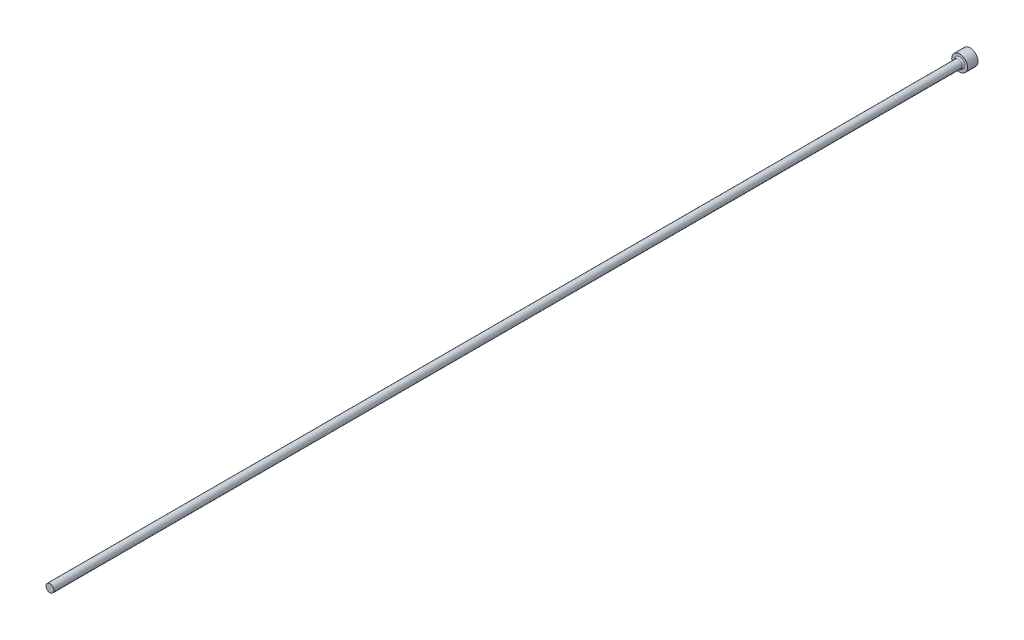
ISO-10303-21;
HEADER;
FILE_DESCRIPTION(('STEP AP214'),'2;1');
FILE_NAME('part.step','',(''),(''),'','','');
FILE_SCHEMA(('AUTOMOTIVE_DESIGN { 1 0 10303 214 1 1 1 1 }'));
ENDSEC;
DATA;
#1=APPLICATION_CONTEXT('core data for automotive mechanical design processes');
#2=APPLICATION_PROTOCOL_DEFINITION('international standard','automotive_design',2000,#1);
#3=PRODUCT_CONTEXT('',#1,'mechanical');
#4=PRODUCT('Part','Part','',(#3));
#5=PRODUCT_RELATED_PRODUCT_CATEGORY('part','',(#4));
#6=PRODUCT_DEFINITION_FORMATION('','',#4);
#7=PRODUCT_DEFINITION_CONTEXT('part definition',#1,'design');
#8=PRODUCT_DEFINITION('design','',#6,#7);
#9=PRODUCT_DEFINITION_SHAPE('','',#8);
#10=(LENGTH_UNIT() NAMED_UNIT(*) SI_UNIT(.MILLI.,.METRE.));
#11=(NAMED_UNIT(*) PLANE_ANGLE_UNIT() SI_UNIT($,.RADIAN.));
#12=(NAMED_UNIT(*) SI_UNIT($,.STERADIAN.) SOLID_ANGLE_UNIT());
#13=UNCERTAINTY_MEASURE_WITH_UNIT(LENGTH_MEASURE(1.E-05),#10,'distance_accuracy_value','');
#14=(GEOMETRIC_REPRESENTATION_CONTEXT(3) GLOBAL_UNCERTAINTY_ASSIGNED_CONTEXT((#13)) GLOBAL_UNIT_ASSIGNED_CONTEXT((#10,
#11,#12)) REPRESENTATION_CONTEXT('',''));
#15=CARTESIAN_POINT('',(0.,0.,0.));
#16=DIRECTION('',(0.,0.,1.));
#17=DIRECTION('',(1.,0.,0.));
#18=AXIS2_PLACEMENT_3D('',#15,#16,#17);
#19=CARTESIAN_POINT('',(3.,0.,4.));
#20=DIRECTION('',(0.,0.,-1.));
#21=DIRECTION('',(-1.,0.,0.));
#22=AXIS2_PLACEMENT_3D('',#19,#20,#21);
#23=PLANE('',#22);
#24=CARTESIAN_POINT('',(0.,0.,4.));
#25=DIRECTION('',(0.,0.,-1.));
#26=DIRECTION('',(-1.,0.,0.));
#27=AXIS2_PLACEMENT_3D('',#24,#25,#26);
#28=CIRCLE('',#27,2.00000000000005);
#29=CARTESIAN_POINT('',(-2.00000000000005,0.,4.));
#30=VERTEX_POINT('',#29);
#31=EDGE_CURVE('E40',#30,#30,#28,.T.);
#32=ORIENTED_EDGE('',*,*,#31,.T.);
#33=EDGE_LOOP('',(#32));
#34=FACE_BOUND('',#33,.T.);
#35=CARTESIAN_POINT('',(0.,0.,4.));
#36=DIRECTION('',(0.,0.,-1.));
#37=DIRECTION('',(-1.,0.,0.));
#38=AXIS2_PLACEMENT_3D('',#35,#36,#37);
#39=CIRCLE('',#38,3.);
#40=CARTESIAN_POINT('',(-3.,0.,4.));
#41=VERTEX_POINT('',#40);
#42=EDGE_CURVE('E44',#41,#41,#39,.T.);
#43=ORIENTED_EDGE('',*,*,#42,.F.);
#44=EDGE_LOOP('',(#43));
#45=FACE_BOUND('',#44,.T.);
#46=ADVANCED_FACE('F33',(#34,#45),#23,.F.);
#47=CARTESIAN_POINT('',(0.,0.,-9.03322817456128));
#48=DIRECTION('',(0.,0.,-1.));
#49=DIRECTION('',(-1.,0.,0.));
#50=AXIS2_PLACEMENT_3D('',#47,#48,#49);
#51=CYLINDRICAL_SURFACE('',#50,3.);
#52=CARTESIAN_POINT('',(0.,0.,0.));
#53=DIRECTION('',(0.,0.,-1.));
#54=DIRECTION('',(-1.,0.,0.));
#55=AXIS2_PLACEMENT_3D('',#52,#53,#54);
#56=CIRCLE('',#55,3.);
#57=CARTESIAN_POINT('',(-3.,0.,0.));
#58=VERTEX_POINT('',#57);
#59=EDGE_CURVE('E48',#58,#58,#56,.T.);
#60=ORIENTED_EDGE('',*,*,#59,.F.);
#61=EDGE_LOOP('',(#60));
#62=FACE_BOUND('',#61,.T.);
#63=ORIENTED_EDGE('',*,*,#42,.T.);
#64=EDGE_LOOP('',(#63));
#65=FACE_BOUND('',#64,.T.);
#66=ADVANCED_FACE('F68',(#62,#65),#51,.T.);
#67=CARTESIAN_POINT('',(0.,0.,0.));
#68=DIRECTION('',(0.,0.,1.));
#69=DIRECTION('',(1.,0.,0.));
#70=AXIS2_PLACEMENT_3D('',#67,#68,#69);
#71=PLANE('',#70);
#72=ORIENTED_EDGE('',*,*,#59,.T.);
#73=EDGE_LOOP('',(#72));
#74=FACE_BOUND('',#73,.T.);
#75=ADVANCED_FACE('F61',(#74),#71,.F.);
#76=CARTESIAN_POINT('',(0.,0.,350.));
#77=DIRECTION('',(0.,0.,-1.));
#78=DIRECTION('',(-1.,0.,0.));
#79=AXIS2_PLACEMENT_3D('',#76,#77,#78);
#80=PLANE('',#79);
#81=CARTESIAN_POINT('',(0.,0.,350.));
#82=DIRECTION('',(0.,0.,-1.));
#83=DIRECTION('',(-1.,0.,0.));
#84=AXIS2_PLACEMENT_3D('',#81,#82,#83);
#85=CIRCLE('',#84,1.50000000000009);
#86=CARTESIAN_POINT('',(-1.50000000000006,0.,350.));
#87=VERTEX_POINT('',#86);
#88=EDGE_CURVE('E53',#87,#87,#85,.T.);
#89=ORIENTED_EDGE('',*,*,#88,.F.);
#90=EDGE_LOOP('',(#89));
#91=FACE_BOUND('',#90,.T.);
#92=ADVANCED_FACE('F59',(#91),#80,.F.);
#93=CARTESIAN_POINT('',(0.,0.,-9.03322817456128));
#94=DIRECTION('',(0.,0.,-1.));
#95=DIRECTION('',(-1.,0.,0.));
#96=AXIS2_PLACEMENT_3D('',#93,#94,#95);
#97=CYLINDRICAL_SURFACE('',#96,1.50000000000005);
#98=CARTESIAN_POINT('',(0.,0.,4.5));
#99=DIRECTION('',(0.,0.,-1.));
#100=DIRECTION('',(-1.,0.,0.));
#101=AXIS2_PLACEMENT_3D('',#98,#99,#100);
#102=CIRCLE('',#101,1.50000000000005);
#103=CARTESIAN_POINT('',(-1.50000000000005,0.,4.5));
#104=VERTEX_POINT('',#103);
#105=EDGE_CURVE('E10',#104,#104,#102,.F.);
#106=ORIENTED_EDGE('',*,*,#105,.T.);
#107=EDGE_LOOP('',(#106));
#108=FACE_BOUND('',#107,.T.);
#109=ORIENTED_EDGE('',*,*,#88,.T.);
#110=EDGE_LOOP('',(#109));
#111=FACE_BOUND('',#110,.T.);
#112=ADVANCED_FACE('F57',(#108,#111),#97,.T.);
#113=CARTESIAN_POINT('',(0.,0.,4.5));
#114=DIRECTION('',(0.,0.,-1.));
#115=DIRECTION('',(-1.,0.,0.));
#116=AXIS2_PLACEMENT_3D('',#113,#114,#115);
#117=TOROIDAL_SURFACE('',#116,2.00000000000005,0.5);
#118=ORIENTED_EDGE('',*,*,#105,.F.);
#119=EDGE_LOOP('',(#118));
#120=FACE_BOUND('',#119,.T.);
#121=ORIENTED_EDGE('',*,*,#31,.F.);
#122=EDGE_LOOP('',(#121));
#123=FACE_BOUND('',#122,.T.);
#124=ADVANCED_FACE('F35',(#120,#123),#117,.F.);
#125=CLOSED_SHELL('',(#46,#66,#75,#92,#112,#124));
#126=MANIFOLD_SOLID_BREP('B2',#125);
#127=ADVANCED_BREP_SHAPE_REPRESENTATION('',(#18,#126),#14);
#128=SHAPE_DEFINITION_REPRESENTATION(#9,#127);
ENDSEC;
END-ISO-10303-21;
